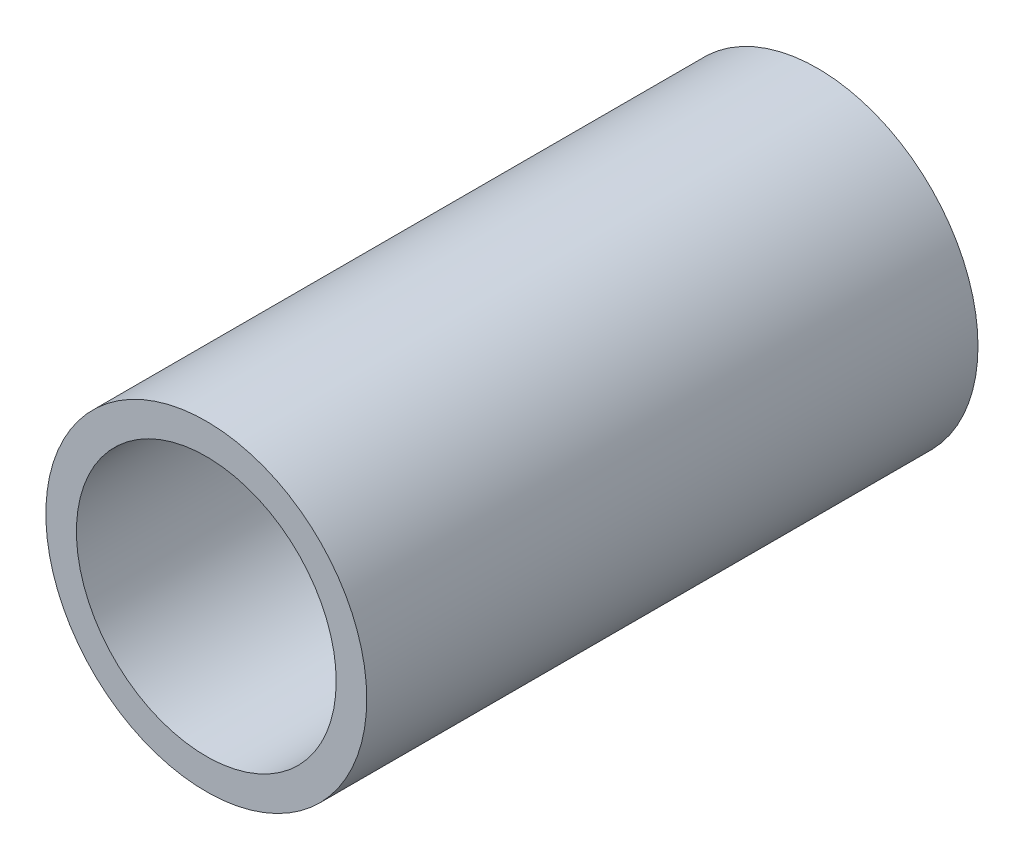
ISO-10303-21;
HEADER;
FILE_DESCRIPTION(('STEP AP214'),'2;1');
FILE_NAME('part.step','',(''),(''),'','','');
FILE_SCHEMA(('AUTOMOTIVE_DESIGN { 1 0 10303 214 1 1 1 1 }'));
ENDSEC;
DATA;
#1=APPLICATION_CONTEXT('core data for automotive mechanical design processes');
#2=APPLICATION_PROTOCOL_DEFINITION('international standard','automotive_design',2000,#1);
#3=PRODUCT_CONTEXT('',#1,'mechanical');
#4=PRODUCT('Part','Part','',(#3));
#5=PRODUCT_RELATED_PRODUCT_CATEGORY('part','',(#4));
#6=PRODUCT_DEFINITION_FORMATION('','',#4);
#7=PRODUCT_DEFINITION_CONTEXT('part definition',#1,'design');
#8=PRODUCT_DEFINITION('design','',#6,#7);
#9=PRODUCT_DEFINITION_SHAPE('','',#8);
#10=(LENGTH_UNIT() NAMED_UNIT(*) SI_UNIT(.MILLI.,.METRE.));
#11=(NAMED_UNIT(*) PLANE_ANGLE_UNIT() SI_UNIT($,.RADIAN.));
#12=(NAMED_UNIT(*) SI_UNIT($,.STERADIAN.) SOLID_ANGLE_UNIT());
#13=UNCERTAINTY_MEASURE_WITH_UNIT(LENGTH_MEASURE(1.E-05),#10,'distance_accuracy_value','');
#14=(GEOMETRIC_REPRESENTATION_CONTEXT(3) GLOBAL_UNCERTAINTY_ASSIGNED_CONTEXT((#13)) GLOBAL_UNIT_ASSIGNED_CONTEXT((#10,
#11,#12)) REPRESENTATION_CONTEXT('',''));
#15=CARTESIAN_POINT('',(0.,0.,0.));
#16=DIRECTION('',(0.,0.,1.));
#17=DIRECTION('',(1.,0.,0.));
#18=AXIS2_PLACEMENT_3D('',#15,#16,#17);
#19=CARTESIAN_POINT('',(0.,0.,127.));
#20=DIRECTION('',(0.,0.,1.));
#21=DIRECTION('',(1.,0.,0.));
#22=AXIS2_PLACEMENT_3D('',#19,#20,#21);
#23=PLANE('',#22);
#24=CARTESIAN_POINT('',(0.,0.,127.));
#25=DIRECTION('',(0.,0.,1.));
#26=DIRECTION('',(1.,0.,0.));
#27=AXIS2_PLACEMENT_3D('',#24,#25,#26);
#28=CIRCLE('',#27,33.3375);
#29=CARTESIAN_POINT('',(33.3375,0.,127.));
#30=VERTEX_POINT('',#29);
#31=EDGE_CURVE('E10',#30,#30,#28,.T.);
#32=ORIENTED_EDGE('',*,*,#31,.T.);
#33=EDGE_LOOP('',(#32));
#34=FACE_BOUND('',#33,.T.);
#35=CARTESIAN_POINT('',(0.,0.,127.));
#36=DIRECTION('',(0.,0.,1.));
#37=DIRECTION('',(1.,0.,0.));
#38=AXIS2_PLACEMENT_3D('',#35,#36,#37);
#39=CIRCLE('',#38,26.9875);
#40=CARTESIAN_POINT('',(26.9875,0.,127.));
#41=VERTEX_POINT('',#40);
#42=EDGE_CURVE('E50',#41,#41,#39,.T.);
#43=ORIENTED_EDGE('',*,*,#42,.F.);
#44=EDGE_LOOP('',(#43));
#45=FACE_BOUND('',#44,.T.);
#46=ADVANCED_FACE('F37',(#34,#45),#23,.T.);
#47=CARTESIAN_POINT('',(0.,0.,0.));
#48=DIRECTION('',(0.,0.,1.));
#49=DIRECTION('',(1.,0.,0.));
#50=AXIS2_PLACEMENT_3D('',#47,#48,#49);
#51=PLANE('',#50);
#52=CARTESIAN_POINT('',(0.,0.,0.));
#53=DIRECTION('',(0.,0.,1.));
#54=DIRECTION('',(1.,0.,0.));
#55=AXIS2_PLACEMENT_3D('',#52,#53,#54);
#56=CIRCLE('',#55,33.3375);
#57=CARTESIAN_POINT('',(33.3375,0.,0.));
#58=VERTEX_POINT('',#57);
#59=EDGE_CURVE('E41',#58,#58,#56,.T.);
#60=ORIENTED_EDGE('',*,*,#59,.F.);
#61=EDGE_LOOP('',(#60));
#62=FACE_BOUND('',#61,.T.);
#63=CARTESIAN_POINT('',(0.,0.,0.));
#64=DIRECTION('',(0.,0.,1.));
#65=DIRECTION('',(1.,0.,0.));
#66=AXIS2_PLACEMENT_3D('',#63,#64,#65);
#67=CIRCLE('',#66,26.9875);
#68=CARTESIAN_POINT('',(26.9875,0.,0.));
#69=VERTEX_POINT('',#68);
#70=EDGE_CURVE('E52',#69,#69,#67,.T.);
#71=ORIENTED_EDGE('',*,*,#70,.T.);
#72=EDGE_LOOP('',(#71));
#73=FACE_BOUND('',#72,.T.);
#74=ADVANCED_FACE('F64',(#62,#73),#51,.F.);
#75=CARTESIAN_POINT('',(0.,0.,127.));
#76=DIRECTION('',(0.,0.,-1.));
#77=DIRECTION('',(-1.,0.,0.));
#78=AXIS2_PLACEMENT_3D('',#75,#76,#77);
#79=CYLINDRICAL_SURFACE('',#78,33.3375);
#80=ORIENTED_EDGE('',*,*,#31,.F.);
#81=EDGE_LOOP('',(#80));
#82=FACE_BOUND('',#81,.T.);
#83=ORIENTED_EDGE('',*,*,#59,.T.);
#84=EDGE_LOOP('',(#83));
#85=FACE_BOUND('',#84,.T.);
#86=ADVANCED_FACE('F39',(#82,#85),#79,.T.);
#87=CARTESIAN_POINT('',(0.,0.,127.));
#88=DIRECTION('',(0.,0.,-1.));
#89=DIRECTION('',(-1.,0.,0.));
#90=AXIS2_PLACEMENT_3D('',#87,#88,#89);
#91=CYLINDRICAL_SURFACE('',#90,26.9875);
#92=ORIENTED_EDGE('',*,*,#42,.T.);
#93=EDGE_LOOP('',(#92));
#94=FACE_BOUND('',#93,.T.);
#95=ORIENTED_EDGE('',*,*,#70,.F.);
#96=EDGE_LOOP('',(#95));
#97=FACE_BOUND('',#96,.T.);
#98=ADVANCED_FACE('F60',(#94,#97),#91,.F.);
#99=CLOSED_SHELL('',(#46,#74,#86,#98));
#100=MANIFOLD_SOLID_BREP('B2',#99);
#101=ADVANCED_BREP_SHAPE_REPRESENTATION('',(#18,#100),#14);
#102=SHAPE_DEFINITION_REPRESENTATION(#9,#101);
ENDSEC;
END-ISO-10303-21;
